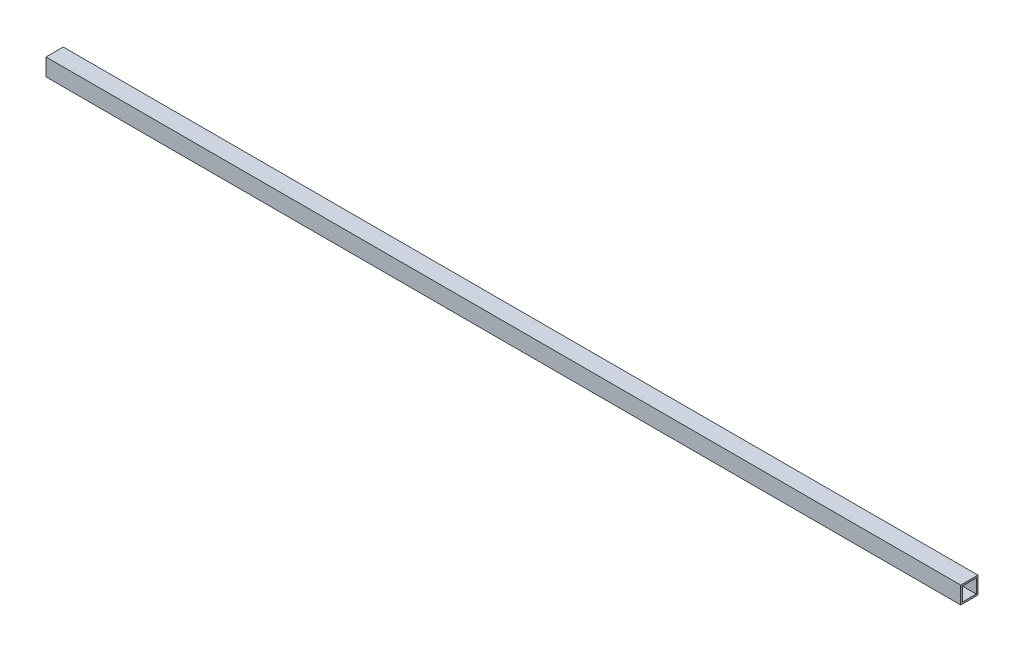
ISO-10303-21;
HEADER;
FILE_DESCRIPTION(('STEP AP214'),'2;1');
FILE_NAME('part.step','',(''),(''),'','','');
FILE_SCHEMA(('AUTOMOTIVE_DESIGN { 1 0 10303 214 1 1 1 1 }'));
ENDSEC;
DATA;
#1=APPLICATION_CONTEXT('core data for automotive mechanical design processes');
#2=APPLICATION_PROTOCOL_DEFINITION('international standard','automotive_design',2000,#1);
#3=PRODUCT_CONTEXT('',#1,'mechanical');
#4=PRODUCT('Part','Part','',(#3));
#5=PRODUCT_RELATED_PRODUCT_CATEGORY('part','',(#4));
#6=PRODUCT_DEFINITION_FORMATION('','',#4);
#7=PRODUCT_DEFINITION_CONTEXT('part definition',#1,'design');
#8=PRODUCT_DEFINITION('design','',#6,#7);
#9=PRODUCT_DEFINITION_SHAPE('','',#8);
#10=(LENGTH_UNIT() NAMED_UNIT(*) SI_UNIT(.MILLI.,.METRE.));
#11=(NAMED_UNIT(*) PLANE_ANGLE_UNIT() SI_UNIT($,.RADIAN.));
#12=(NAMED_UNIT(*) SI_UNIT($,.STERADIAN.) SOLID_ANGLE_UNIT());
#13=UNCERTAINTY_MEASURE_WITH_UNIT(LENGTH_MEASURE(1.E-05),#10,'distance_accuracy_value','');
#14=(GEOMETRIC_REPRESENTATION_CONTEXT(3) GLOBAL_UNCERTAINTY_ASSIGNED_CONTEXT((#13)) GLOBAL_UNIT_ASSIGNED_CONTEXT((#10,
#11,#12)) REPRESENTATION_CONTEXT('',''));
#15=CARTESIAN_POINT('',(0.,0.,0.));
#16=DIRECTION('',(0.,0.,1.));
#17=DIRECTION('',(1.,0.,0.));
#18=AXIS2_PLACEMENT_3D('',#15,#16,#17);
#19=CARTESIAN_POINT('',(1060.,0.,0.));
#20=DIRECTION('',(-1.,0.,0.));
#21=DIRECTION('',(0.,0.,1.));
#22=AXIS2_PLACEMENT_3D('',#19,#20,#21);
#23=PLANE('',#22);
#24=DIRECTION('',(0.,-1.,0.));
#25=VECTOR('',#24,1.);
#26=CARTESIAN_POINT('',(1060.,0.,0.));
#27=LINE('',#26,#25);
#28=CARTESIAN_POINT('',(1060.,20.,0.));
#29=VERTEX_POINT('',#28);
#30=CARTESIAN_POINT('',(1060.,0.,0.));
#31=VERTEX_POINT('',#30);
#32=EDGE_CURVE('E134',#29,#31,#27,.T.);
#33=ORIENTED_EDGE('',*,*,#32,.T.);
#34=DIRECTION('',(0.,0.,-1.));
#35=VECTOR('',#34,1.);
#36=CARTESIAN_POINT('',(1060.,0.,0.));
#37=LINE('',#36,#35);
#38=CARTESIAN_POINT('',(1060.,0.,-20.));
#39=VERTEX_POINT('',#38);
#40=EDGE_CURVE('E137',#31,#39,#37,.T.);
#41=ORIENTED_EDGE('',*,*,#40,.T.);
#42=DIRECTION('',(0.,1.,0.));
#43=VECTOR('',#42,1.);
#44=CARTESIAN_POINT('',(1060.,0.,-20.));
#45=LINE('',#44,#43);
#46=CARTESIAN_POINT('',(1060.,20.,-20.));
#47=VERTEX_POINT('',#46);
#48=EDGE_CURVE('E140',#39,#47,#45,.T.);
#49=ORIENTED_EDGE('',*,*,#48,.T.);
#50=DIRECTION('',(0.,0.,1.));
#51=VECTOR('',#50,1.);
#52=CARTESIAN_POINT('',(1060.,20.,0.));
#53=LINE('',#52,#51);
#54=EDGE_CURVE('E142',#47,#29,#53,.T.);
#55=ORIENTED_EDGE('',*,*,#54,.T.);
#56=EDGE_LOOP('',(#33,#41,#49,#55));
#57=FACE_BOUND('',#56,.T.);
#58=DIRECTION('',(0.,-1.,0.));
#59=VECTOR('',#58,1.);
#60=CARTESIAN_POINT('',(1060.,2.,-2.));
#61=LINE('',#60,#59);
#62=CARTESIAN_POINT('',(1060.,18.,-2.));
#63=VERTEX_POINT('',#62);
#64=CARTESIAN_POINT('',(1060.,2.,-2.));
#65=VERTEX_POINT('',#64);
#66=EDGE_CURVE('E98',#63,#65,#61,.T.);
#67=ORIENTED_EDGE('',*,*,#66,.F.);
#68=DIRECTION('',(0.,0.,1.));
#69=VECTOR('',#68,1.);
#70=CARTESIAN_POINT('',(1060.,18.,-2.));
#71=LINE('',#70,#69);
#72=CARTESIAN_POINT('',(1060.,18.,-18.));
#73=VERTEX_POINT('',#72);
#74=EDGE_CURVE('E120',#73,#63,#71,.T.);
#75=ORIENTED_EDGE('',*,*,#74,.F.);
#76=DIRECTION('',(0.,1.,0.));
#77=VECTOR('',#76,1.);
#78=CARTESIAN_POINT('',(1060.,2.,-18.));
#79=LINE('',#78,#77);
#80=CARTESIAN_POINT('',(1060.,2.,-18.));
#81=VERTEX_POINT('',#80);
#82=EDGE_CURVE('E118',#81,#73,#79,.T.);
#83=ORIENTED_EDGE('',*,*,#82,.F.);
#84=DIRECTION('',(0.,0.,-1.));
#85=VECTOR('',#84,1.);
#86=CARTESIAN_POINT('',(1060.,2.,-2.));
#87=LINE('',#86,#85);
#88=EDGE_CURVE('E106',#65,#81,#87,.T.);
#89=ORIENTED_EDGE('',*,*,#88,.F.);
#90=EDGE_LOOP('',(#67,#75,#83,#89));
#91=FACE_BOUND('',#90,.T.);
#92=ADVANCED_FACE('F33',(#57,#91),#23,.F.);
#93=CARTESIAN_POINT('',(0.,0.,0.));
#94=DIRECTION('',(-1.,0.,0.));
#95=DIRECTION('',(0.,0.,1.));
#96=AXIS2_PLACEMENT_3D('',#93,#94,#95);
#97=PLANE('',#96);
#98=DIRECTION('',(0.,-1.,0.));
#99=VECTOR('',#98,1.);
#100=CARTESIAN_POINT('',(0.,0.,0.));
#101=LINE('',#100,#99);
#102=CARTESIAN_POINT('',(0.,20.,0.));
#103=VERTEX_POINT('',#102);
#104=CARTESIAN_POINT('',(0.,0.,0.));
#105=VERTEX_POINT('',#104);
#106=EDGE_CURVE('E114',#103,#105,#101,.T.);
#107=ORIENTED_EDGE('',*,*,#106,.F.);
#108=DIRECTION('',(0.,0.,1.));
#109=VECTOR('',#108,1.);
#110=CARTESIAN_POINT('',(0.,20.,0.));
#111=LINE('',#110,#109);
#112=CARTESIAN_POINT('',(0.,20.,-20.));
#113=VERTEX_POINT('',#112);
#114=EDGE_CURVE('E138',#113,#103,#111,.T.);
#115=ORIENTED_EDGE('',*,*,#114,.F.);
#116=DIRECTION('',(0.,1.,0.));
#117=VECTOR('',#116,1.);
#118=CARTESIAN_POINT('',(0.,0.,-20.));
#119=LINE('',#118,#117);
#120=CARTESIAN_POINT('',(0.,0.,-20.));
#121=VERTEX_POINT('',#120);
#122=EDGE_CURVE('E149',#121,#113,#119,.T.);
#123=ORIENTED_EDGE('',*,*,#122,.F.);
#124=DIRECTION('',(0.,0.,-1.));
#125=VECTOR('',#124,1.);
#126=CARTESIAN_POINT('',(0.,0.,0.));
#127=LINE('',#126,#125);
#128=EDGE_CURVE('E147',#105,#121,#127,.T.);
#129=ORIENTED_EDGE('',*,*,#128,.F.);
#130=EDGE_LOOP('',(#107,#115,#123,#129));
#131=FACE_BOUND('',#130,.T.);
#132=DIRECTION('',(0.,0.,1.));
#133=VECTOR('',#132,1.);
#134=CARTESIAN_POINT('',(0.,18.,-2.));
#135=LINE('',#134,#133);
#136=CARTESIAN_POINT('',(0.,18.,-18.));
#137=VERTEX_POINT('',#136);
#138=CARTESIAN_POINT('',(0.,18.,-2.));
#139=VERTEX_POINT('',#138);
#140=EDGE_CURVE('E107',#137,#139,#135,.T.);
#141=ORIENTED_EDGE('',*,*,#140,.T.);
#142=DIRECTION('',(0.,-1.,0.));
#143=VECTOR('',#142,1.);
#144=CARTESIAN_POINT('',(0.,2.,-2.));
#145=LINE('',#144,#143);
#146=CARTESIAN_POINT('',(0.,2.,-2.));
#147=VERTEX_POINT('',#146);
#148=EDGE_CURVE('E56',#139,#147,#145,.T.);
#149=ORIENTED_EDGE('',*,*,#148,.T.);
#150=DIRECTION('',(0.,0.,-1.));
#151=VECTOR('',#150,1.);
#152=CARTESIAN_POINT('',(0.,2.,-2.));
#153=LINE('',#152,#151);
#154=CARTESIAN_POINT('',(0.,2.,-18.));
#155=VERTEX_POINT('',#154);
#156=EDGE_CURVE('E113',#147,#155,#153,.T.);
#157=ORIENTED_EDGE('',*,*,#156,.T.);
#158=DIRECTION('',(0.,1.,0.));
#159=VECTOR('',#158,1.);
#160=CARTESIAN_POINT('',(0.,2.,-18.));
#161=LINE('',#160,#159);
#162=EDGE_CURVE('E126',#155,#137,#161,.T.);
#163=ORIENTED_EDGE('',*,*,#162,.T.);
#164=EDGE_LOOP('',(#141,#149,#157,#163));
#165=FACE_BOUND('',#164,.T.);
#166=ADVANCED_FACE('F167',(#131,#165),#97,.T.);
#167=CARTESIAN_POINT('',(1060.,0.,0.));
#168=DIRECTION('',(0.,0.,-1.));
#169=DIRECTION('',(-1.,0.,0.));
#170=AXIS2_PLACEMENT_3D('',#167,#168,#169);
#171=PLANE('',#170);
#172=ORIENTED_EDGE('',*,*,#106,.T.);
#173=DIRECTION('',(-1.,0.,0.));
#174=VECTOR('',#173,1.);
#175=CARTESIAN_POINT('',(1060.,0.,0.));
#176=LINE('',#175,#174);
#177=EDGE_CURVE('E11',#31,#105,#176,.T.);
#178=ORIENTED_EDGE('',*,*,#177,.F.);
#179=ORIENTED_EDGE('',*,*,#32,.F.);
#180=DIRECTION('',(-1.,0.,0.));
#181=VECTOR('',#180,1.);
#182=CARTESIAN_POINT('',(1060.,20.,0.));
#183=LINE('',#182,#181);
#184=EDGE_CURVE('E144',#29,#103,#183,.T.);
#185=ORIENTED_EDGE('',*,*,#184,.T.);
#186=EDGE_LOOP('',(#172,#178,#179,#185));
#187=FACE_BOUND('',#186,.T.);
#188=ADVANCED_FACE('F35',(#187),#171,.F.);
#189=CARTESIAN_POINT('',(1060.,0.,0.));
#190=DIRECTION('',(0.,1.,0.));
#191=DIRECTION('',(0.,0.,1.));
#192=AXIS2_PLACEMENT_3D('',#189,#190,#191);
#193=PLANE('',#192);
#194=ORIENTED_EDGE('',*,*,#128,.T.);
#195=DIRECTION('',(-1.,0.,0.));
#196=VECTOR('',#195,1.);
#197=CARTESIAN_POINT('',(1060.,0.,-20.));
#198=LINE('',#197,#196);
#199=EDGE_CURVE('E41',#39,#121,#198,.T.);
#200=ORIENTED_EDGE('',*,*,#199,.F.);
#201=ORIENTED_EDGE('',*,*,#40,.F.);
#202=ORIENTED_EDGE('',*,*,#177,.T.);
#203=EDGE_LOOP('',(#194,#200,#201,#202));
#204=FACE_BOUND('',#203,.T.);
#205=ADVANCED_FACE('F177',(#204),#193,.F.);
#206=CARTESIAN_POINT('',(1060.,0.,-20.));
#207=DIRECTION('',(0.,0.,1.));
#208=DIRECTION('',(1.,0.,0.));
#209=AXIS2_PLACEMENT_3D('',#206,#207,#208);
#210=PLANE('',#209);
#211=ORIENTED_EDGE('',*,*,#122,.T.);
#212=DIRECTION('',(-1.,0.,0.));
#213=VECTOR('',#212,1.);
#214=CARTESIAN_POINT('',(1060.,20.,-20.));
#215=LINE('',#214,#213);
#216=EDGE_CURVE('E154',#47,#113,#215,.T.);
#217=ORIENTED_EDGE('',*,*,#216,.F.);
#218=ORIENTED_EDGE('',*,*,#48,.F.);
#219=ORIENTED_EDGE('',*,*,#199,.T.);
#220=EDGE_LOOP('',(#211,#217,#218,#219));
#221=FACE_BOUND('',#220,.T.);
#222=ADVANCED_FACE('F161',(#221),#210,.F.);
#223=CARTESIAN_POINT('',(1060.,20.,0.));
#224=DIRECTION('',(0.,-1.,0.));
#225=DIRECTION('',(0.,0.,-1.));
#226=AXIS2_PLACEMENT_3D('',#223,#224,#225);
#227=PLANE('',#226);
#228=ORIENTED_EDGE('',*,*,#114,.T.);
#229=ORIENTED_EDGE('',*,*,#184,.F.);
#230=ORIENTED_EDGE('',*,*,#54,.F.);
#231=ORIENTED_EDGE('',*,*,#216,.T.);
#232=EDGE_LOOP('',(#228,#229,#230,#231));
#233=FACE_BOUND('',#232,.T.);
#234=ADVANCED_FACE('F171',(#233),#227,.F.);
#235=CARTESIAN_POINT('',(1060.,2.,-2.));
#236=DIRECTION('',(0.,0.,-1.));
#237=DIRECTION('',(-1.,0.,0.));
#238=AXIS2_PLACEMENT_3D('',#235,#236,#237);
#239=PLANE('',#238);
#240=ORIENTED_EDGE('',*,*,#148,.F.);
#241=DIRECTION('',(-1.,0.,0.));
#242=VECTOR('',#241,1.);
#243=CARTESIAN_POINT('',(1060.,18.,-2.));
#244=LINE('',#243,#242);
#245=EDGE_CURVE('E102',#63,#139,#244,.T.);
#246=ORIENTED_EDGE('',*,*,#245,.F.);
#247=ORIENTED_EDGE('',*,*,#66,.T.);
#248=DIRECTION('',(-1.,0.,0.));
#249=VECTOR('',#248,1.);
#250=CARTESIAN_POINT('',(1060.,2.,-2.));
#251=LINE('',#250,#249);
#252=EDGE_CURVE('E101',#65,#147,#251,.T.);
#253=ORIENTED_EDGE('',*,*,#252,.T.);
#254=EDGE_LOOP('',(#240,#246,#247,#253));
#255=FACE_BOUND('',#254,.T.);
#256=ADVANCED_FACE('F100',(#255),#239,.T.);
#257=CARTESIAN_POINT('',(1060.,2.,-2.));
#258=DIRECTION('',(0.,1.,0.));
#259=DIRECTION('',(0.,0.,1.));
#260=AXIS2_PLACEMENT_3D('',#257,#258,#259);
#261=PLANE('',#260);
#262=ORIENTED_EDGE('',*,*,#156,.F.);
#263=ORIENTED_EDGE('',*,*,#252,.F.);
#264=ORIENTED_EDGE('',*,*,#88,.T.);
#265=DIRECTION('',(-1.,0.,0.));
#266=VECTOR('',#265,1.);
#267=CARTESIAN_POINT('',(1060.,2.,-18.));
#268=LINE('',#267,#266);
#269=EDGE_CURVE('E115',#81,#155,#268,.T.);
#270=ORIENTED_EDGE('',*,*,#269,.T.);
#271=EDGE_LOOP('',(#262,#263,#264,#270));
#272=FACE_BOUND('',#271,.T.);
#273=ADVANCED_FACE('F110',(#272),#261,.T.);
#274=CARTESIAN_POINT('',(1060.,2.,-18.));
#275=DIRECTION('',(0.,0.,1.));
#276=DIRECTION('',(1.,0.,0.));
#277=AXIS2_PLACEMENT_3D('',#274,#275,#276);
#278=PLANE('',#277);
#279=ORIENTED_EDGE('',*,*,#162,.F.);
#280=ORIENTED_EDGE('',*,*,#269,.F.);
#281=ORIENTED_EDGE('',*,*,#82,.T.);
#282=DIRECTION('',(-1.,0.,0.));
#283=VECTOR('',#282,1.);
#284=CARTESIAN_POINT('',(1060.,18.,-18.));
#285=LINE('',#284,#283);
#286=EDGE_CURVE('E48',#73,#137,#285,.T.);
#287=ORIENTED_EDGE('',*,*,#286,.T.);
#288=EDGE_LOOP('',(#279,#280,#281,#287));
#289=FACE_BOUND('',#288,.T.);
#290=ADVANCED_FACE('F200',(#289),#278,.T.);
#291=CARTESIAN_POINT('',(1060.,18.,-2.));
#292=DIRECTION('',(0.,-1.,0.));
#293=DIRECTION('',(0.,0.,-1.));
#294=AXIS2_PLACEMENT_3D('',#291,#292,#293);
#295=PLANE('',#294);
#296=ORIENTED_EDGE('',*,*,#140,.F.);
#297=ORIENTED_EDGE('',*,*,#286,.F.);
#298=ORIENTED_EDGE('',*,*,#74,.T.);
#299=ORIENTED_EDGE('',*,*,#245,.T.);
#300=EDGE_LOOP('',(#296,#297,#298,#299));
#301=FACE_BOUND('',#300,.T.);
#302=ADVANCED_FACE('F204',(#301),#295,.T.);
#303=CLOSED_SHELL('',(#92,#166,#188,#205,#222,#234,#256,#273,#290,#302));
#304=MANIFOLD_SOLID_BREP('B2',#303);
#305=ADVANCED_BREP_SHAPE_REPRESENTATION('',(#18,#304),#14);
#306=SHAPE_DEFINITION_REPRESENTATION(#9,#305);
ENDSEC;
END-ISO-10303-21;
